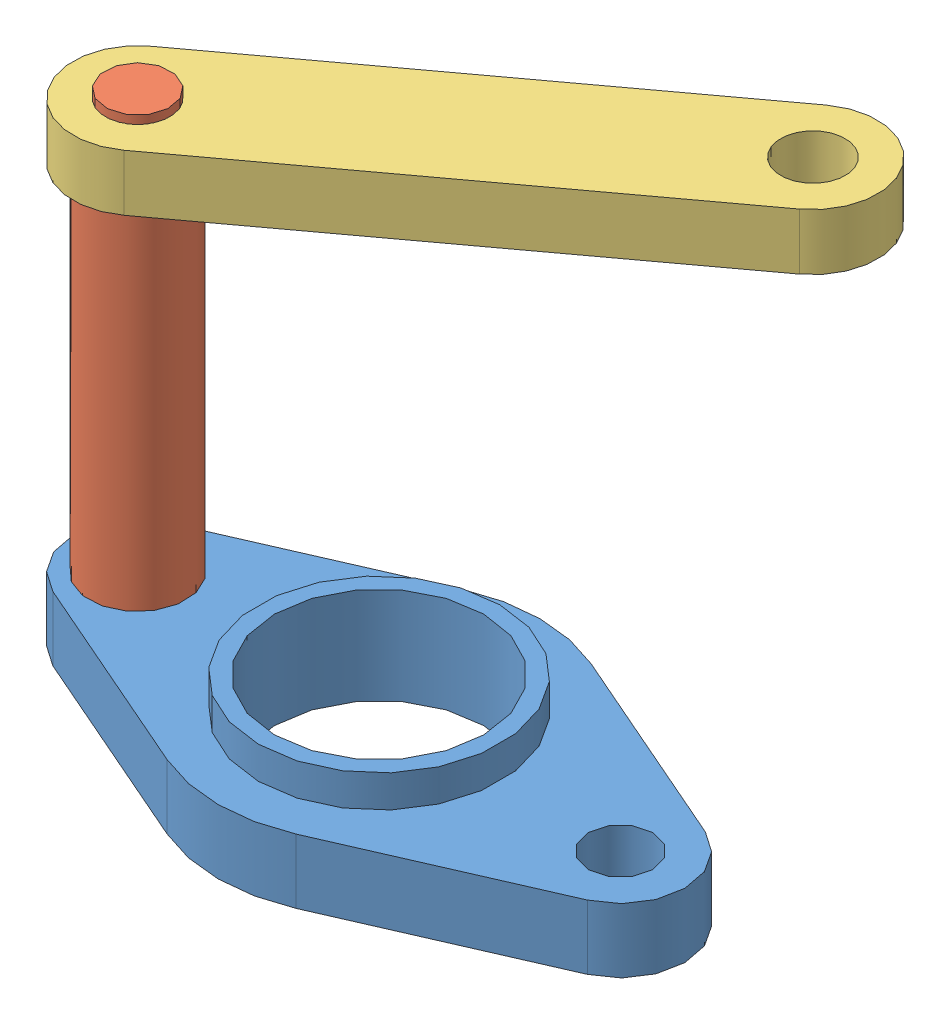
SolidWorks assembly Angle Constraint.SLDASM, configuration Default (file format 8000). Lengths in mm.
Overall size (197.97 150 167.03).
3 component instances, 3 part files, 5 mates.
Components (placement in the parent):
- base-1: base.SLDPRT [Default] at origin size (190 30 100)
- pin-1: pin.SLDPRT [Default] at (-10.804 0 38.7798) x (0.855947 0 0.517064) z (-0.517064 0 0.855947) size (30 150 30)
- upper link-1: upper link.SLDPRT [Default] at (-14.6499 130 -44.5294) x (-0.804668 0 0.593725) z (0 1 0) size (190 40 17.5)
Mates (geometry in assembly coordinates):
- Concentric1: concentric aligned: cylinder of pin-1 through (-75 0 0) axis (0 -1 0) radius 10; cylinder of upper link-1 through (-75 147.5 0) axis (0 -1 0) radius 10
- Coincident7: coincident anti-aligned: plane of pin-1 through (-62.1608 130 7.756) normal (0 1 0); plane of upper link-1 through (-75 130 0) normal (0 -1 0)
- Concentric2: concentric aligned: cylinder of base-1 through (-75 20 0) axis (0 -1 0) radius 10; cylinder of pin-1 through (-75 0 0) axis (0 -1 0) radius 10
- Coincident8: coincident anti-aligned: plane of base-1 through (-167.5297 20 0.5275) normal (0 1 0); plane of pin-1 through (-66.4405 20 5.1706) normal (0 -1 0)
- Angle1: planar angle = 1.047198 rad aligned: plane of upper link-1 through (-63.1255 147.5 16.0934) normal (0.593725 0 0.804668); plane of base-1 through (-160.5315 20 -15.5072) normal (-0.4 0 0.916515)
